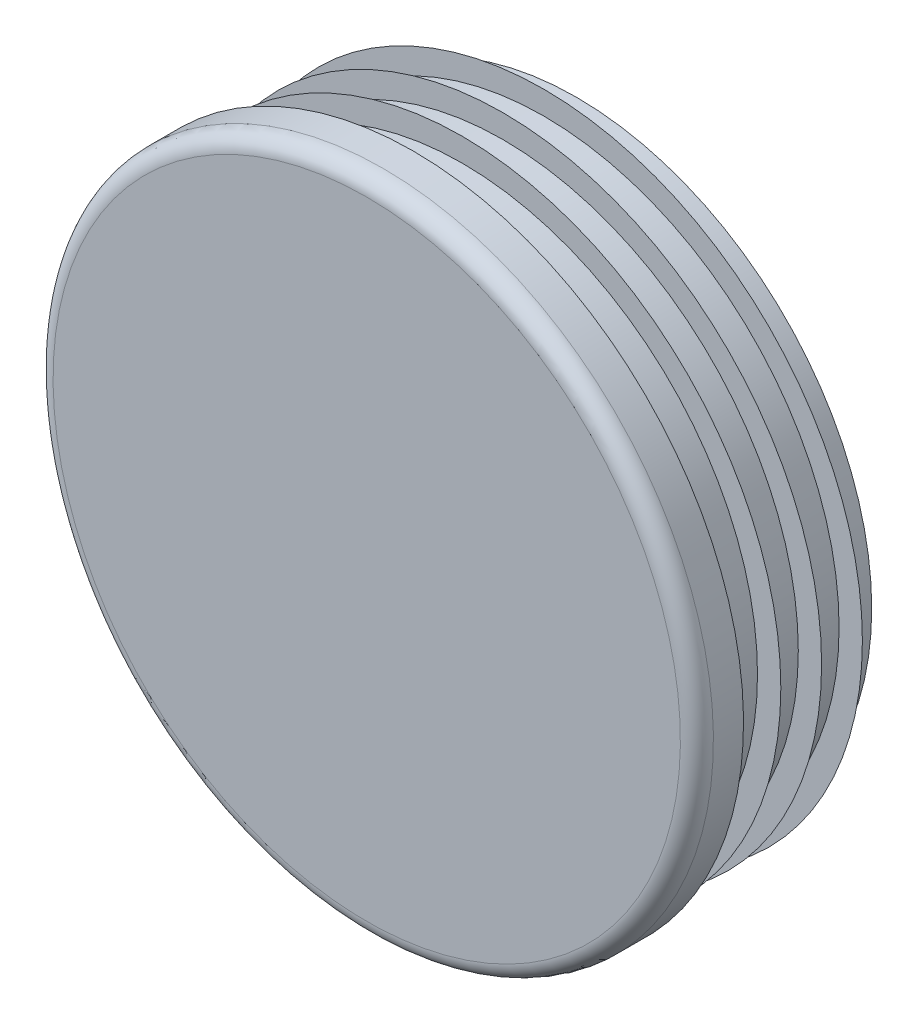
ISO-10303-21;
HEADER;
FILE_DESCRIPTION(('STEP AP214'),'2;1');
FILE_NAME('part.step','',(''),(''),'','','');
FILE_SCHEMA(('AUTOMOTIVE_DESIGN { 1 0 10303 214 1 1 1 1 }'));
ENDSEC;
DATA;
#1=APPLICATION_CONTEXT('core data for automotive mechanical design processes');
#2=APPLICATION_PROTOCOL_DEFINITION('international standard','automotive_design',2000,#1);
#3=PRODUCT_CONTEXT('',#1,'mechanical');
#4=PRODUCT('Part','Part','',(#3));
#5=PRODUCT_RELATED_PRODUCT_CATEGORY('part','',(#4));
#6=PRODUCT_DEFINITION_FORMATION('','',#4);
#7=PRODUCT_DEFINITION_CONTEXT('part definition',#1,'design');
#8=PRODUCT_DEFINITION('design','',#6,#7);
#9=PRODUCT_DEFINITION_SHAPE('','',#8);
#10=(LENGTH_UNIT() NAMED_UNIT(*) SI_UNIT(.MILLI.,.METRE.));
#11=(NAMED_UNIT(*) PLANE_ANGLE_UNIT() SI_UNIT($,.RADIAN.));
#12=(NAMED_UNIT(*) SI_UNIT($,.STERADIAN.) SOLID_ANGLE_UNIT());
#13=UNCERTAINTY_MEASURE_WITH_UNIT(LENGTH_MEASURE(1.E-05),#10,'distance_accuracy_value','');
#14=(GEOMETRIC_REPRESENTATION_CONTEXT(3) GLOBAL_UNCERTAINTY_ASSIGNED_CONTEXT((#13)) GLOBAL_UNIT_ASSIGNED_CONTEXT((#10,
#11,#12)) REPRESENTATION_CONTEXT('',''));
#15=CARTESIAN_POINT('',(0.,0.,0.));
#16=DIRECTION('',(0.,0.,1.));
#17=DIRECTION('',(1.,0.,0.));
#18=AXIS2_PLACEMENT_3D('',#15,#16,#17);
#19=CARTESIAN_POINT('',(0.,0.,6.));
#20=DIRECTION('',(0.,0.,-1.));
#21=DIRECTION('',(0.,1.,0.));
#22=AXIS2_PLACEMENT_3D('',#19,#20,#21);
#23=PLANE('',#22);
#24=CARTESIAN_POINT('',(0.,0.,6.));
#25=DIRECTION('',(0.,0.,-1.));
#26=DIRECTION('',(0.,1.,0.));
#27=AXIS2_PLACEMENT_3D('',#24,#25,#26);
#28=CIRCLE('',#27,40.375);
#29=CARTESIAN_POINT('',(0.,40.375,6.));
#30=VERTEX_POINT('',#29);
#31=EDGE_CURVE('E8',#30,#30,#28,.T.);
#32=ORIENTED_EDGE('',*,*,#31,.F.);
#33=EDGE_LOOP('',(#32));
#34=FACE_BOUND('',#33,.T.);
#35=ADVANCED_FACE('F12',(#34),#23,.F.);
#36=CARTESIAN_POINT('',(0.,0.,3.875));
#37=DIRECTION('',(0.,0.,-1.));
#38=DIRECTION('',(0.,1.,0.));
#39=AXIS2_PLACEMENT_3D('',#36,#37,#38);
#40=TOROIDAL_SURFACE('',#39,40.375,2.125);
#41=ORIENTED_EDGE('',*,*,#31,.T.);
#42=EDGE_LOOP('',(#41));
#43=FACE_BOUND('',#42,.T.);
#44=CARTESIAN_POINT('',(0.,0.,3.875));
#45=DIRECTION('',(0.,0.,-1.));
#46=DIRECTION('',(0.,1.,0.));
#47=AXIS2_PLACEMENT_3D('',#44,#45,#46);
#48=CIRCLE('',#47,42.5);
#49=CARTESIAN_POINT('',(0.,42.5,3.875));
#50=VERTEX_POINT('',#49);
#51=EDGE_CURVE('E18',#50,#50,#48,.T.);
#52=ORIENTED_EDGE('',*,*,#51,.F.);
#53=EDGE_LOOP('',(#52));
#54=FACE_BOUND('',#53,.T.);
#55=ADVANCED_FACE('F159',(#43,#54),#40,.T.);
#56=CARTESIAN_POINT('',(0.,0.,-21.));
#57=DIRECTION('',(0.,0.,-1.));
#58=DIRECTION('',(0.,1.,0.));
#59=AXIS2_PLACEMENT_3D('',#56,#57,#58);
#60=CYLINDRICAL_SURFACE('',#59,42.5);
#61=CARTESIAN_POINT('',(0.,0.,0.));
#62=DIRECTION('',(0.,0.,-1.));
#63=DIRECTION('',(0.,1.,0.));
#64=AXIS2_PLACEMENT_3D('',#61,#62,#63);
#65=CIRCLE('',#64,42.5);
#66=CARTESIAN_POINT('',(0.,42.5,0.));
#67=VERTEX_POINT('',#66);
#68=EDGE_CURVE('E22',#67,#67,#65,.T.);
#69=ORIENTED_EDGE('',*,*,#68,.F.);
#70=EDGE_LOOP('',(#69));
#71=FACE_BOUND('',#70,.T.);
#72=ORIENTED_EDGE('',*,*,#51,.T.);
#73=EDGE_LOOP('',(#72));
#74=FACE_BOUND('',#73,.T.);
#75=ADVANCED_FACE('F154',(#71,#74),#60,.T.);
#76=CARTESIAN_POINT('',(42.5,0.,0.));
#77=DIRECTION('',(0.,0.,1.));
#78=DIRECTION('',(0.,-1.,0.));
#79=AXIS2_PLACEMENT_3D('',#76,#77,#78);
#80=PLANE('',#79);
#81=CARTESIAN_POINT('',(0.,0.,0.));
#82=DIRECTION('',(0.,0.,-1.));
#83=DIRECTION('',(0.,1.,0.));
#84=AXIS2_PLACEMENT_3D('',#81,#82,#83);
#85=CIRCLE('',#84,38.);
#86=CARTESIAN_POINT('',(0.,38.,0.));
#87=VERTEX_POINT('',#86);
#88=EDGE_CURVE('E26',#87,#87,#85,.T.);
#89=ORIENTED_EDGE('',*,*,#88,.F.);
#90=EDGE_LOOP('',(#89));
#91=FACE_BOUND('',#90,.T.);
#92=ORIENTED_EDGE('',*,*,#68,.T.);
#93=EDGE_LOOP('',(#92));
#94=FACE_BOUND('',#93,.T.);
#95=ADVANCED_FACE('F148',(#91,#94),#80,.F.);
#96=CARTESIAN_POINT('',(0.,0.,-21.));
#97=DIRECTION('',(0.,0.,-1.));
#98=DIRECTION('',(0.,1.,0.));
#99=AXIS2_PLACEMENT_3D('',#96,#97,#98);
#100=CYLINDRICAL_SURFACE('',#99,38.);
#101=CARTESIAN_POINT('',(0.,0.,-1.05));
#102=DIRECTION('',(0.,0.,-1.));
#103=DIRECTION('',(0.,1.,0.));
#104=AXIS2_PLACEMENT_3D('',#101,#102,#103);
#105=CIRCLE('',#104,38.);
#106=CARTESIAN_POINT('',(0.,38.,-1.05));
#107=VERTEX_POINT('',#106);
#108=EDGE_CURVE('E31',#107,#107,#105,.T.);
#109=ORIENTED_EDGE('',*,*,#108,.F.);
#110=EDGE_LOOP('',(#109));
#111=FACE_BOUND('',#110,.T.);
#112=ORIENTED_EDGE('',*,*,#88,.T.);
#113=EDGE_LOOP('',(#112));
#114=FACE_BOUND('',#113,.T.);
#115=ADVANCED_FACE('F142',(#111,#114),#100,.T.);
#116=CARTESIAN_POINT('',(38.,0.,-1.05));
#117=DIRECTION('',(0.,0.,-1.));
#118=DIRECTION('',(0.,1.,0.));
#119=AXIS2_PLACEMENT_3D('',#116,#117,#118);
#120=PLANE('',#119);
#121=CARTESIAN_POINT('',(0.,0.,-1.05));
#122=DIRECTION('',(0.,0.,-1.));
#123=DIRECTION('',(0.,1.,0.));
#124=AXIS2_PLACEMENT_3D('',#121,#122,#123);
#125=CIRCLE('',#124,41.);
#126=CARTESIAN_POINT('',(0.,41.,-1.05));
#127=VERTEX_POINT('',#126);
#128=EDGE_CURVE('E34',#127,#127,#125,.T.);
#129=ORIENTED_EDGE('',*,*,#128,.F.);
#130=EDGE_LOOP('',(#129));
#131=FACE_BOUND('',#130,.T.);
#132=ORIENTED_EDGE('',*,*,#108,.T.);
#133=EDGE_LOOP('',(#132));
#134=FACE_BOUND('',#133,.T.);
#135=ADVANCED_FACE('F136',(#131,#134),#120,.F.);
#136=CARTESIAN_POINT('',(0.,0.,-1.05));
#137=DIRECTION('',(0.,0.,1.));
#138=DIRECTION('',(0.,-1.,0.));
#139=AXIS2_PLACEMENT_3D('',#136,#137,#138);
#140=CONICAL_SURFACE('',#139,41.,0.959931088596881);
#141=CARTESIAN_POINT('',(0.,0.,-3.15062261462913));
#142=DIRECTION('',(0.,0.,-1.));
#143=DIRECTION('',(0.,1.,0.));
#144=AXIS2_PLACEMENT_3D('',#141,#142,#143);
#145=CIRCLE('',#144,38.);
#146=CARTESIAN_POINT('',(0.,38.,-3.15062261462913));
#147=VERTEX_POINT('',#146);
#148=EDGE_CURVE('E37',#147,#147,#145,.T.);
#149=ORIENTED_EDGE('',*,*,#148,.F.);
#150=EDGE_LOOP('',(#149));
#151=FACE_BOUND('',#150,.T.);
#152=ORIENTED_EDGE('',*,*,#128,.T.);
#153=EDGE_LOOP('',(#152));
#154=FACE_BOUND('',#153,.T.);
#155=ADVANCED_FACE('F130',(#151,#154),#140,.T.);
#156=CARTESIAN_POINT('',(0.,0.,-21.));
#157=DIRECTION('',(0.,0.,-1.));
#158=DIRECTION('',(0.,1.,0.));
#159=AXIS2_PLACEMENT_3D('',#156,#157,#158);
#160=CYLINDRICAL_SURFACE('',#159,38.);
#161=CARTESIAN_POINT('',(0.,0.,-6.3));
#162=DIRECTION('',(0.,0.,-1.));
#163=DIRECTION('',(0.,1.,0.));
#164=AXIS2_PLACEMENT_3D('',#161,#162,#163);
#165=CIRCLE('',#164,38.);
#166=CARTESIAN_POINT('',(0.,38.,-6.3));
#167=VERTEX_POINT('',#166);
#168=EDGE_CURVE('E40',#167,#167,#165,.T.);
#169=ORIENTED_EDGE('',*,*,#168,.F.);
#170=EDGE_LOOP('',(#169));
#171=FACE_BOUND('',#170,.T.);
#172=ORIENTED_EDGE('',*,*,#148,.T.);
#173=EDGE_LOOP('',(#172));
#174=FACE_BOUND('',#173,.T.);
#175=ADVANCED_FACE('F124',(#171,#174),#160,.T.);
#176=CARTESIAN_POINT('',(38.,0.,-6.3));
#177=DIRECTION('',(0.,0.,-1.));
#178=DIRECTION('',(0.,1.,0.));
#179=AXIS2_PLACEMENT_3D('',#176,#177,#178);
#180=PLANE('',#179);
#181=CARTESIAN_POINT('',(0.,0.,-6.3));
#182=DIRECTION('',(0.,0.,-1.));
#183=DIRECTION('',(0.,1.,0.));
#184=AXIS2_PLACEMENT_3D('',#181,#182,#183);
#185=CIRCLE('',#184,41.);
#186=CARTESIAN_POINT('',(0.,41.,-6.3));
#187=VERTEX_POINT('',#186);
#188=EDGE_CURVE('E43',#187,#187,#185,.T.);
#189=ORIENTED_EDGE('',*,*,#188,.F.);
#190=EDGE_LOOP('',(#189));
#191=FACE_BOUND('',#190,.T.);
#192=ORIENTED_EDGE('',*,*,#168,.T.);
#193=EDGE_LOOP('',(#192));
#194=FACE_BOUND('',#193,.T.);
#195=ADVANCED_FACE('F118',(#191,#194),#180,.F.);
#196=CARTESIAN_POINT('',(0.,0.,-6.3));
#197=DIRECTION('',(0.,0.,1.));
#198=DIRECTION('',(0.,-1.,0.));
#199=AXIS2_PLACEMENT_3D('',#196,#197,#198);
#200=CONICAL_SURFACE('',#199,41.,0.959931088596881);
#201=CARTESIAN_POINT('',(0.,0.,-8.40062261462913));
#202=DIRECTION('',(0.,0.,-1.));
#203=DIRECTION('',(0.,1.,0.));
#204=AXIS2_PLACEMENT_3D('',#201,#202,#203);
#205=CIRCLE('',#204,38.);
#206=CARTESIAN_POINT('',(0.,38.,-8.40062261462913));
#207=VERTEX_POINT('',#206);
#208=EDGE_CURVE('E46',#207,#207,#205,.T.);
#209=ORIENTED_EDGE('',*,*,#208,.F.);
#210=EDGE_LOOP('',(#209));
#211=FACE_BOUND('',#210,.T.);
#212=ORIENTED_EDGE('',*,*,#188,.T.);
#213=EDGE_LOOP('',(#212));
#214=FACE_BOUND('',#213,.T.);
#215=ADVANCED_FACE('F112',(#211,#214),#200,.T.);
#216=CARTESIAN_POINT('',(0.,0.,-21.));
#217=DIRECTION('',(0.,0.,-1.));
#218=DIRECTION('',(0.,1.,0.));
#219=AXIS2_PLACEMENT_3D('',#216,#217,#218);
#220=CYLINDRICAL_SURFACE('',#219,38.);
#221=CARTESIAN_POINT('',(0.,0.,-11.55));
#222=DIRECTION('',(0.,0.,-1.));
#223=DIRECTION('',(0.,1.,0.));
#224=AXIS2_PLACEMENT_3D('',#221,#222,#223);
#225=CIRCLE('',#224,38.);
#226=CARTESIAN_POINT('',(0.,38.,-11.55));
#227=VERTEX_POINT('',#226);
#228=EDGE_CURVE('E49',#227,#227,#225,.T.);
#229=ORIENTED_EDGE('',*,*,#228,.F.);
#230=EDGE_LOOP('',(#229));
#231=FACE_BOUND('',#230,.T.);
#232=ORIENTED_EDGE('',*,*,#208,.T.);
#233=EDGE_LOOP('',(#232));
#234=FACE_BOUND('',#233,.T.);
#235=ADVANCED_FACE('F106',(#231,#234),#220,.T.);
#236=CARTESIAN_POINT('',(38.,0.,-11.55));
#237=DIRECTION('',(0.,0.,-1.));
#238=DIRECTION('',(0.,1.,0.));
#239=AXIS2_PLACEMENT_3D('',#236,#237,#238);
#240=PLANE('',#239);
#241=CARTESIAN_POINT('',(0.,0.,-11.55));
#242=DIRECTION('',(0.,0.,-1.));
#243=DIRECTION('',(0.,1.,0.));
#244=AXIS2_PLACEMENT_3D('',#241,#242,#243);
#245=CIRCLE('',#244,41.);
#246=CARTESIAN_POINT('',(0.,41.,-11.55));
#247=VERTEX_POINT('',#246);
#248=EDGE_CURVE('E52',#247,#247,#245,.T.);
#249=ORIENTED_EDGE('',*,*,#248,.F.);
#250=EDGE_LOOP('',(#249));
#251=FACE_BOUND('',#250,.T.);
#252=ORIENTED_EDGE('',*,*,#228,.T.);
#253=EDGE_LOOP('',(#252));
#254=FACE_BOUND('',#253,.T.);
#255=ADVANCED_FACE('F100',(#251,#254),#240,.F.);
#256=CARTESIAN_POINT('',(0.,0.,-11.55));
#257=DIRECTION('',(0.,0.,1.));
#258=DIRECTION('',(0.,-1.,0.));
#259=AXIS2_PLACEMENT_3D('',#256,#257,#258);
#260=CONICAL_SURFACE('',#259,41.,0.959931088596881);
#261=CARTESIAN_POINT('',(0.,0.,-13.6506226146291));
#262=DIRECTION('',(0.,0.,-1.));
#263=DIRECTION('',(0.,1.,0.));
#264=AXIS2_PLACEMENT_3D('',#261,#262,#263);
#265=CIRCLE('',#264,38.);
#266=CARTESIAN_POINT('',(0.,38.,-13.6506226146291));
#267=VERTEX_POINT('',#266);
#268=EDGE_CURVE('E55',#267,#267,#265,.T.);
#269=ORIENTED_EDGE('',*,*,#268,.F.);
#270=EDGE_LOOP('',(#269));
#271=FACE_BOUND('',#270,.T.);
#272=ORIENTED_EDGE('',*,*,#248,.T.);
#273=EDGE_LOOP('',(#272));
#274=FACE_BOUND('',#273,.T.);
#275=ADVANCED_FACE('F94',(#271,#274),#260,.T.);
#276=CARTESIAN_POINT('',(0.,0.,-21.));
#277=DIRECTION('',(0.,0.,-1.));
#278=DIRECTION('',(0.,1.,0.));
#279=AXIS2_PLACEMENT_3D('',#276,#277,#278);
#280=CYLINDRICAL_SURFACE('',#279,38.);
#281=CARTESIAN_POINT('',(0.,0.,-16.8));
#282=DIRECTION('',(0.,0.,-1.));
#283=DIRECTION('',(0.,1.,0.));
#284=AXIS2_PLACEMENT_3D('',#281,#282,#283);
#285=CIRCLE('',#284,38.);
#286=CARTESIAN_POINT('',(0.,38.,-16.8));
#287=VERTEX_POINT('',#286);
#288=EDGE_CURVE('E58',#287,#287,#285,.T.);
#289=ORIENTED_EDGE('',*,*,#288,.F.);
#290=EDGE_LOOP('',(#289));
#291=FACE_BOUND('',#290,.T.);
#292=ORIENTED_EDGE('',*,*,#268,.T.);
#293=EDGE_LOOP('',(#292));
#294=FACE_BOUND('',#293,.T.);
#295=ADVANCED_FACE('F88',(#291,#294),#280,.T.);
#296=CARTESIAN_POINT('',(38.,0.,-16.8));
#297=DIRECTION('',(0.,0.,-1.));
#298=DIRECTION('',(0.,1.,0.));
#299=AXIS2_PLACEMENT_3D('',#296,#297,#298);
#300=PLANE('',#299);
#301=CARTESIAN_POINT('',(0.,0.,-16.8));
#302=DIRECTION('',(0.,0.,-1.));
#303=DIRECTION('',(0.,1.,0.));
#304=AXIS2_PLACEMENT_3D('',#301,#302,#303);
#305=CIRCLE('',#304,41.);
#306=CARTESIAN_POINT('',(0.,41.,-16.8));
#307=VERTEX_POINT('',#306);
#308=EDGE_CURVE('E61',#307,#307,#305,.T.);
#309=ORIENTED_EDGE('',*,*,#308,.F.);
#310=EDGE_LOOP('',(#309));
#311=FACE_BOUND('',#310,.T.);
#312=ORIENTED_EDGE('',*,*,#288,.T.);
#313=EDGE_LOOP('',(#312));
#314=FACE_BOUND('',#313,.T.);
#315=ADVANCED_FACE('F82',(#311,#314),#300,.F.);
#316=CARTESIAN_POINT('',(0.,0.,-16.8));
#317=DIRECTION('',(0.,0.,1.));
#318=DIRECTION('',(0.,-1.,0.));
#319=AXIS2_PLACEMENT_3D('',#316,#317,#318);
#320=CONICAL_SURFACE('',#319,41.,0.959931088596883);
#321=CARTESIAN_POINT('',(0.,0.,-18.9006226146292));
#322=DIRECTION('',(0.,0.,-1.));
#323=DIRECTION('',(0.,1.,0.));
#324=AXIS2_PLACEMENT_3D('',#321,#322,#323);
#325=CIRCLE('',#324,38.);
#326=CARTESIAN_POINT('',(0.,38.,-18.9006226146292));
#327=VERTEX_POINT('',#326);
#328=EDGE_CURVE('E64',#327,#327,#325,.T.);
#329=ORIENTED_EDGE('',*,*,#328,.F.);
#330=EDGE_LOOP('',(#329));
#331=FACE_BOUND('',#330,.T.);
#332=ORIENTED_EDGE('',*,*,#308,.T.);
#333=EDGE_LOOP('',(#332));
#334=FACE_BOUND('',#333,.T.);
#335=ADVANCED_FACE('F76',(#331,#334),#320,.T.);
#336=CARTESIAN_POINT('',(0.,0.,-21.));
#337=DIRECTION('',(0.,0.,-1.));
#338=DIRECTION('',(0.,1.,0.));
#339=AXIS2_PLACEMENT_3D('',#336,#337,#338);
#340=CYLINDRICAL_SURFACE('',#339,38.);
#341=CARTESIAN_POINT('',(0.,0.,-21.));
#342=DIRECTION('',(0.,0.,-1.));
#343=DIRECTION('',(0.,1.,0.));
#344=AXIS2_PLACEMENT_3D('',#341,#342,#343);
#345=CIRCLE('',#344,38.);
#346=CARTESIAN_POINT('',(0.,38.,-21.));
#347=VERTEX_POINT('',#346);
#348=EDGE_CURVE('E67',#347,#347,#345,.T.);
#349=ORIENTED_EDGE('',*,*,#348,.F.);
#350=EDGE_LOOP('',(#349));
#351=FACE_BOUND('',#350,.T.);
#352=ORIENTED_EDGE('',*,*,#328,.T.);
#353=EDGE_LOOP('',(#352));
#354=FACE_BOUND('',#353,.T.);
#355=ADVANCED_FACE('F73',(#351,#354),#340,.T.);
#356=CARTESIAN_POINT('',(38.,0.,-21.));
#357=DIRECTION('',(0.,0.,1.));
#358=DIRECTION('',(0.,-1.,0.));
#359=AXIS2_PLACEMENT_3D('',#356,#357,#358);
#360=PLANE('',#359);
#361=ORIENTED_EDGE('',*,*,#348,.T.);
#362=EDGE_LOOP('',(#361));
#363=FACE_BOUND('',#362,.T.);
#364=ADVANCED_FACE('F71',(#363),#360,.F.);
#365=CLOSED_SHELL('',(#35,#55,#75,#95,#115,#135,#155,#175,#195,#215,#235,#255,#275,#295,#315,
#335,#355,#364));
#366=MANIFOLD_SOLID_BREP('B1',#365);
#367=ADVANCED_BREP_SHAPE_REPRESENTATION('',(#18,#366),#14);
#368=SHAPE_DEFINITION_REPRESENTATION(#9,#367);
ENDSEC;
END-ISO-10303-21;
